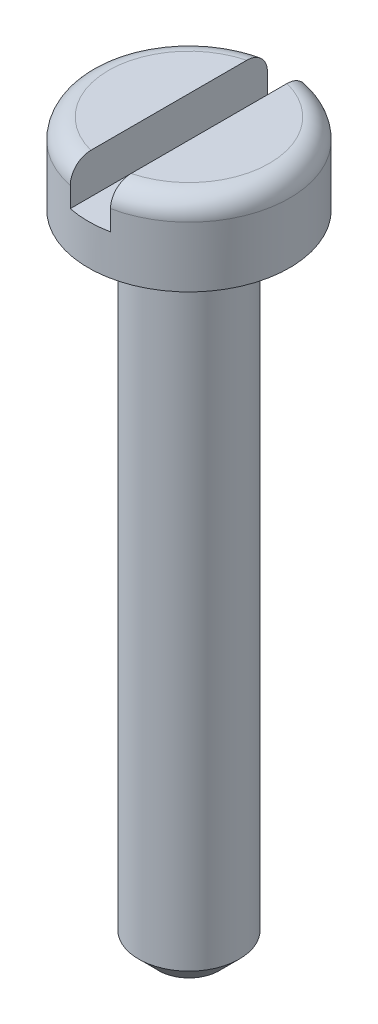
from build123d import *

# Parameters (mm, degrees)
ENL_V_MAT_EXTRU_1_DEPTH      = 19.343936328
ENL_V_MAT_EXTRU_1_DEPTH_BACK = 19.343936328
ESQUISSE3_W                  = 1
ESQUISSE3_H                  = 2
CHANFREIN1_SIZE              = 0.5


with BuildPart() as part:
    # Esquisse2 → R_volution1 (revolve)
    with BuildSketch(Plane(origin=(0, 0, 0), x_dir=(0, 0, -1), z_dir=(1, 0, 0))):
        with BuildLine():
            Line((0, 0), (0, 18))
            Line((0, 18), (2, 18))
            ThreePointArc((2, 18), (2.353553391, 17.853553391), (2.5, 17.5))
            Line((2.5, 17.5), (2.5, 16))
            Line((2.5, 16), (1.25, 16))
            Line((1.25, 16), (1.25, 0))
            Line((1.25, 0), (0, 0))
        make_face()
    revolve(axis=Axis((0, 0, 0), (0, 1, 0)))

    # Esquisse3 → Enl_v. mat.-Extru.1 (cut, two sides: drawn at the far end of the back side and taken through both)
    with BuildSketch(Plane.XY.offset(-ENL_V_MAT_EXTRU_1_DEPTH_BACK)):
        with Locations((0, 18)):
            Rectangle(ESQUISSE3_W, ESQUISSE3_H)
    extrude(amount=ENL_V_MAT_EXTRU_1_DEPTH + ENL_V_MAT_EXTRU_1_DEPTH_BACK, mode=Mode.SUBTRACT)

    # Chanfrein1
    chanfrein1_edges = [part.edges().sort_by_distance(p)[0] for p in [
        (0, 0, 1.25),
    ]]
    chamfer(chanfrein1_edges, length=CHANFREIN1_SIZE)


solid = part.part
